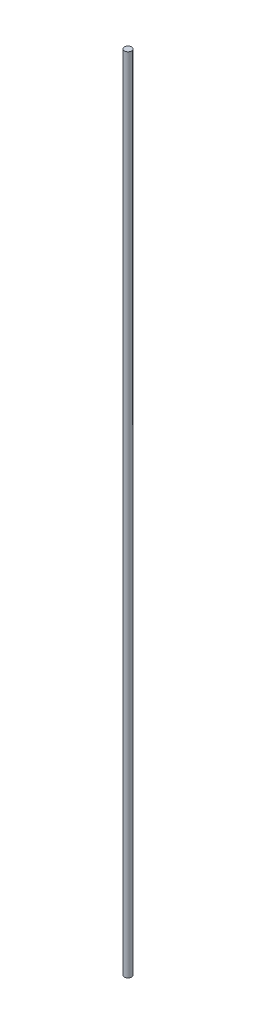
from build123d import *

# Parameters (mm, degrees)
SKETCH1_R           = 4
BOSS_EXTRUDE1_DEPTH = 900


with BuildPart() as part:
    # Sketch1 → Boss-Extrude1 (new body)
    with BuildSketch(Plane(origin=(0, 0, 0), x_dir=(1, 0, 0), z_dir=(0, 1, 0))):
        with Locations(Location((0, 0, 0), (0, 0, 270))):
            Circle(SKETCH1_R)
    extrude(amount=BOSS_EXTRUDE1_DEPTH)


solid = part.part
